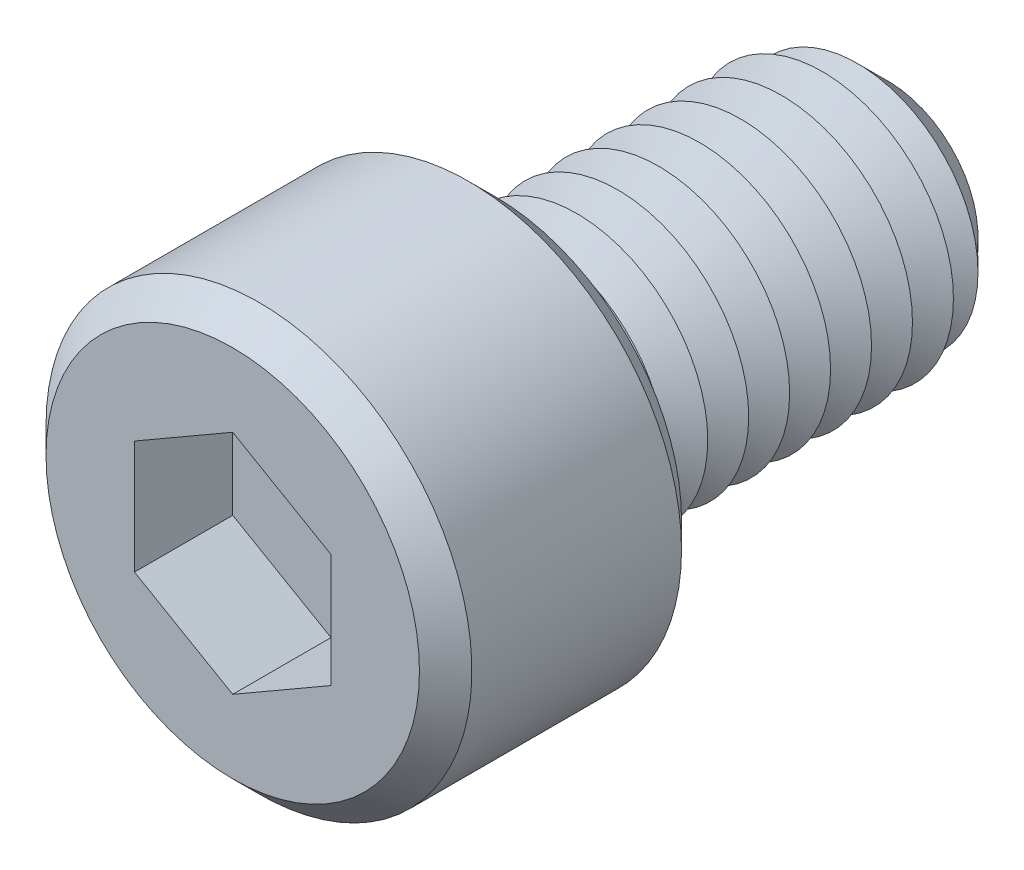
from build123d import *

# Parameters (mm, degrees)
SKETCH1_R           = 6.5
BOSS_EXTRUDE1_DEPTH = 8
SKETCH2_R           = 4
BOSS_EXTRUDE2_DEPTH = 12
CHAMFER1_SIZE       = 1.25
LPATTERN1_COUNT     = 9
LPATTERN1_PITCH     = 1.25
CUT_EXTRUDE1_DEPTH  = 3
SKETCH6_R           = 0.9
CUT_EXTRUDE2_DEPTH  = 17
CHAMFER2_SIZE       = 0.8


with BuildPart() as part:
    # Sketch1 → Boss-Extrude1 (new body)
    with BuildSketch(Plane.XY):
        Circle(SKETCH1_R)
    extrude(amount=BOSS_EXTRUDE1_DEPTH)

    # Sketch2 → Boss-Extrude2 (add)
    with BuildSketch(Plane(origin=(0, 0, 0), x_dir=(-1, 0, 0), z_dir=(0, 0, -1))):
        Circle(SKETCH2_R)
    extrude(amount=BOSS_EXTRUDE2_DEPTH)

    # Chamfer1
    chamfer1_edges = [part.edges().sort_by_distance(p)[0] for p in [
        (4, 0, -12),
    ]]
    chamfer(chamfer1_edges, length=CHAMFER1_SIZE)

    # Sketch4 → Cut-Revolve1 (revolve, cut)
    with BuildSketch(Plane(origin=(0, 0, 0), x_dir=(0, 0, -1), z_dir=(1, 0, 0)), mode=Mode.PRIVATE) as cut_revolve1_sk:
        Polygon((0, 4), (0.625, 2.917468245), (1.25, 4), align=None)
    cut_revolve1 = revolve(cut_revolve1_sk.sketch.rotate(Axis((0, 0, 2.512122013), (0, 0, -1)), 90), axis=Axis((0, 0, 2.512122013), (0, 0, -1)), mode=Mode.SUBTRACT)

    # LPattern1: Cut-Revolve1 ×9
    with Locations(*[(0, 0, -i * LPATTERN1_PITCH) for i in range(1, LPATTERN1_COUNT)]):
        add(cut_revolve1, mode=Mode.SUBTRACT)

    # Sketch5 → Cut-Extrude1 (cut)
    with BuildSketch(Plane.XY.offset(8)):
        Polygon((0, 3.464101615), (-3, 1.732050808), (-3, -1.732050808), (0, -3.464101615), (3, -1.732050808), (3, 1.732050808), align=None)
    extrude(amount=-CUT_EXTRUDE1_DEPTH, mode=Mode.SUBTRACT)

    # Sketch6 → Cut-Extrude2 (cut)
    with BuildSketch(Plane.XY.offset(5)):
        Circle(SKETCH6_R)
    extrude(amount=-CUT_EXTRUDE2_DEPTH, mode=Mode.SUBTRACT)

    # Chamfer2
    chamfer2_edges = [part.edges().sort_by_distance(p)[0] for p in [
        (-6.5, 0, 0),
        (-6.5, 0, 8),
    ]]
    chamfer(chamfer2_edges, length=CHAMFER2_SIZE)


solid = part.part
